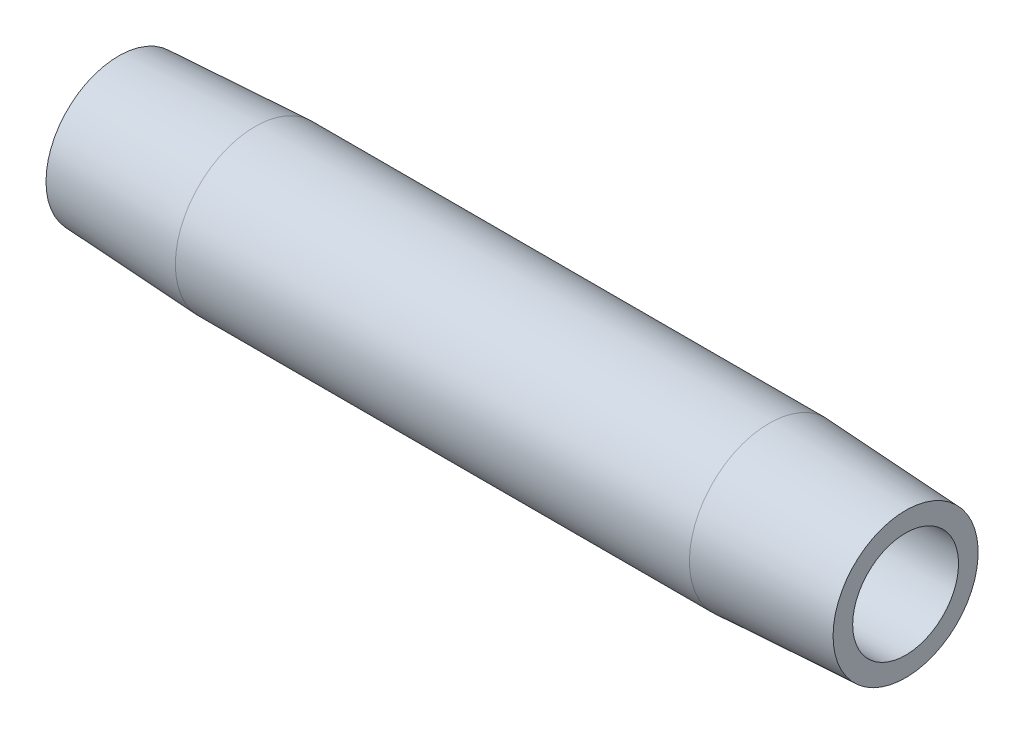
from build123d import *


with BuildPart() as part:
    # Sketch2 → Revolve1 (revolve)
    with BuildSketch(Plane.XY, mode=Mode.PRIVATE) as revolve1_sk:
        Polygon((8.810039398, 5.1435), (0, 4.6817854), (0, 3.4163), (50.8, 3.4163), (50.8, 4.6817854), (41.989960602, 5.1435), align=None)
    revolve(revolve1_sk.sketch.rotate(Axis((0.476141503, 0, 0), (1, 0, 0)), 90), axis=Axis((0.476141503, 0, 0), (1, 0, 0)))


solid = part.part
